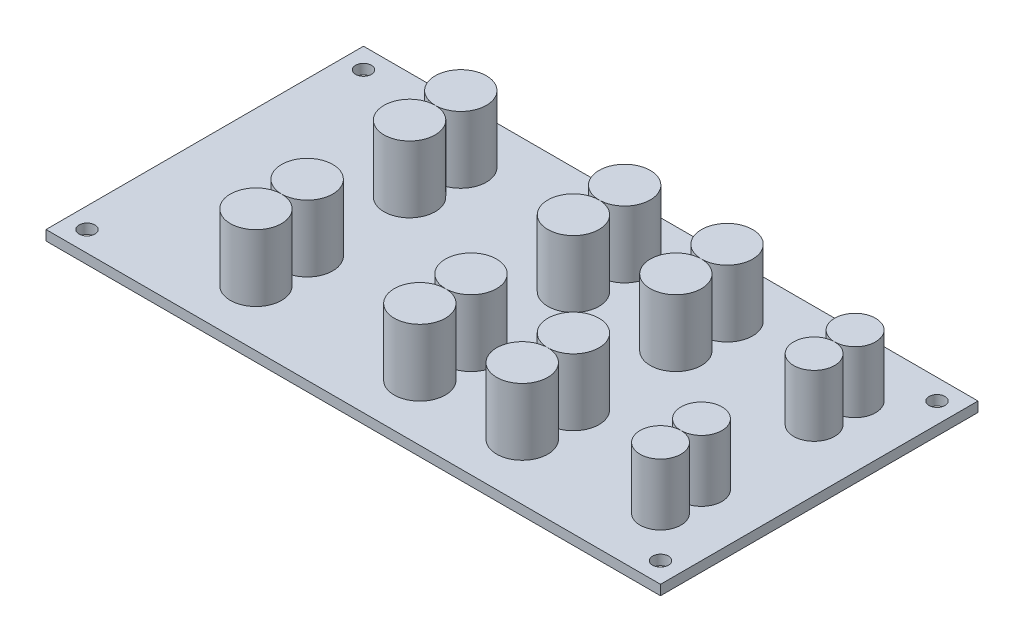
from build123d import *

# Parameters (mm, degrees)
SKETCH_1_W         = 120
SKETCH_1_H         = 62
SKETCH_1_R         = 1.55
EXTRUDE_1_DEPTH    = 1.95
SKETCH_2_R         = 5
EXTRUDE_3_DEPTH    = 13
EXTRUDE_3_2_DEPTH  = 13
EXTRUDE_3_3_DEPTH  = 13
EXTRUDE_3_4_DEPTH  = 13
EXTRUDE_3_5_DEPTH  = 13
EXTRUDE_3_6_DEPTH  = 13
EXTRUDE_3_7_DEPTH  = 13
EXTRUDE_3_8_DEPTH  = 13
EXTRUDE_3_9_DEPTH  = 13
EXTRUDE_3_10_DEPTH = 13
EXTRUDE_3_11_DEPTH = 13
EXTRUDE_3_12_DEPTH = 13
SKETCH_2_3_R       = 4
EXTRUDE_4_DEPTH    = 12
EXTRUDE_4_2_DEPTH  = 12
EXTRUDE_4_3_DEPTH  = 12
EXTRUDE_4_4_DEPTH  = 12


with BuildPart() as part:
    # Sketch 1 → Extrude 1 (new body)
    with BuildSketch(Plane(origin=(0, 0, 0), x_dir=(1, 0, 0), z_dir=(0, 1, 0))):
        Rectangle(SKETCH_1_W, SKETCH_1_H)
        with Locations(Location((-56, 27, 0), (0, 0, 270))):
            Circle(SKETCH_1_R, mode=Mode.SUBTRACT)
        with Locations(Location((56, 27, 0), (0, 0, 270))):
            Circle(SKETCH_1_R, mode=Mode.SUBTRACT)
        with Locations(Location((56, -27, 0), (0, 0, 270))):
            Circle(SKETCH_1_R, mode=Mode.SUBTRACT)
        with Locations(Location((-56, -27, 0), (0, 0, 270))):
            Circle(SKETCH_1_R, mode=Mode.SUBTRACT)
    extrude(amount=EXTRUDE_1_DEPTH)


with BuildPart() as body_2:
    # Sketch 2 → Extrude 3 (new body)
    with BuildSketch(Plane(origin=(0, 1.95, 0), x_dir=(1, 0, 0), z_dir=(0, 1, 0))):
        with Locations(Location((-30, 20, 0), (0, 0, 90))):
            Circle(SKETCH_2_R)
    extrude(amount=EXTRUDE_3_DEPTH)


with BuildPart() as body_3:
    # Sketch 2 → Extrude 3 2 (new body)
    with BuildSketch(Plane(origin=(0, 1.95, 0), x_dir=(1, 0, 0), z_dir=(0, 1, 0))):
        with Locations(Location((-30, 10, 0), (0, 0, 90))):
            Circle(SKETCH_2_R)
    extrude(amount=EXTRUDE_3_2_DEPTH)


with BuildPart() as body_4:
    # Sketch 2 → Extrude 3 3 (new body)
    with BuildSketch(Plane(origin=(0, 1.95, 0), x_dir=(1, 0, 0), z_dir=(0, 1, 0))):
        with Locations(Location((-30, -10, 0), (0, 0, 90))):
            Circle(SKETCH_2_R)
    extrude(amount=EXTRUDE_3_3_DEPTH)


with BuildPart() as body_5:
    # Sketch 2 → Extrude 3 4 (new body)
    with BuildSketch(Plane(origin=(0, 1.95, 0), x_dir=(1, 0, 0), z_dir=(0, 1, 0))):
        with Locations(Location((-30, -20, 0), (0, 0, 90))):
            Circle(SKETCH_2_R)
    extrude(amount=EXTRUDE_3_4_DEPTH)


with BuildPart() as body_6:
    # Sketch 2 → Extrude 3 5 (new body)
    with BuildSketch(Plane(origin=(0, 1.95, 0), x_dir=(1, 0, 0), z_dir=(0, 1, 0))):
        with Locations(Location((2, -20, 0), (0, 0, 90))):
            Circle(SKETCH_2_R)
    extrude(amount=EXTRUDE_3_5_DEPTH)


with BuildPart() as body_7:
    # Sketch 2 → Extrude 3 6 (new body)
    with BuildSketch(Plane(origin=(0, 1.95, 0), x_dir=(1, 0, 0), z_dir=(0, 1, 0))):
        with Locations(Location((2, -10, 0), (0, 0, 90))):
            Circle(SKETCH_2_R)
    extrude(amount=EXTRUDE_3_6_DEPTH)


with BuildPart() as body_8:
    # Sketch 2 → Extrude 3 7 (new body)
    with BuildSketch(Plane(origin=(0, 1.95, 0), x_dir=(1, 0, 0), z_dir=(0, 1, 0))):
        with Locations(Location((2, 10, 0), (0, 0, 90))):
            Circle(SKETCH_2_R)
    extrude(amount=EXTRUDE_3_7_DEPTH)


with BuildPart() as body_9:
    # Sketch 2 → Extrude 3 8 (new body)
    with BuildSketch(Plane(origin=(0, 1.95, 0), x_dir=(1, 0, 0), z_dir=(0, 1, 0))):
        with Locations(Location((2, 20, 0), (0, 0, 90))):
            Circle(SKETCH_2_R)
    extrude(amount=EXTRUDE_3_8_DEPTH)


with BuildPart() as body_10:
    # Sketch 2 → Extrude 3 9 (new body)
    with BuildSketch(Plane(origin=(0, 1.95, 0), x_dir=(1, 0, 0), z_dir=(0, 1, 0))):
        with Locations(Location((22, 20, 0), (0, 0, 90))):
            Circle(SKETCH_2_R)
    extrude(amount=EXTRUDE_3_9_DEPTH)


with BuildPart() as body_11:
    # Sketch 2 → Extrude 3 10 (new body)
    with BuildSketch(Plane(origin=(0, 1.95, 0), x_dir=(1, 0, 0), z_dir=(0, 1, 0))):
        with Locations(Location((22, 10, 0), (0, 0, 90))):
            Circle(SKETCH_2_R)
    extrude(amount=EXTRUDE_3_10_DEPTH)


with BuildPart() as body_12:
    # Sketch 2 → Extrude 3 11 (new body)
    with BuildSketch(Plane(origin=(0, 1.95, 0), x_dir=(1, 0, 0), z_dir=(0, 1, 0))):
        with Locations(Location((22, -10, 0), (0, 0, 90))):
            Circle(SKETCH_2_R)
    extrude(amount=EXTRUDE_3_11_DEPTH)


with BuildPart() as body_13:
    # Sketch 2 → Extrude 3 12 (new body)
    with BuildSketch(Plane(origin=(0, 1.95, 0), x_dir=(1, 0, 0), z_dir=(0, 1, 0))):
        with Locations(Location((22, -20, 0), (0, 0, 90))):
            Circle(SKETCH_2_R)
    extrude(amount=EXTRUDE_3_12_DEPTH)


with BuildPart() as body_14:
    # Sketch 2_3 → Extrude 4 (new body)
    with BuildSketch(Plane(origin=(0, 1.95, 0), x_dir=(1, 0, 0), z_dir=(0, 1, 0))):
        with Locations(Location((48, 11, 0), (0, 0, 270))):
            Circle(SKETCH_2_3_R)
    extrude(amount=EXTRUDE_4_DEPTH)


with BuildPart() as body_15:
    # Sketch 2_3 → Extrude 4 2 (new body)
    with BuildSketch(Plane(origin=(0, 1.95, 0), x_dir=(1, 0, 0), z_dir=(0, 1, 0))):
        with Locations(Location((48, 19, 0), (0, 0, 270))):
            Circle(SKETCH_2_3_R)
    extrude(amount=EXTRUDE_4_2_DEPTH)


with BuildPart() as body_16:
    # Sketch 2_3 → Extrude 4 3 (new body)
    with BuildSketch(Plane(origin=(0, 1.95, 0), x_dir=(1, 0, 0), z_dir=(0, 1, 0))):
        with Locations(Location((48, -11, 0), (0, 0, 270))):
            Circle(SKETCH_2_3_R)
    extrude(amount=EXTRUDE_4_3_DEPTH)


with BuildPart() as body_17:
    # Sketch 2_3 → Extrude 4 4 (new body)
    with BuildSketch(Plane(origin=(0, 1.95, 0), x_dir=(1, 0, 0), z_dir=(0, 1, 0))):
        with Locations(Location((48, -19, 0), (0, 0, 270))):
            Circle(SKETCH_2_3_R)
    extrude(amount=EXTRUDE_4_4_DEPTH)


solid = Compound([part.part, body_2.part, body_3.part, body_4.part, body_5.part, body_6.part, body_7.part, body_8.part, body_9.part, body_10.part, body_11.part, body_12.part, body_13.part, body_14.part, body_15.part, body_16.part, body_17.part])
